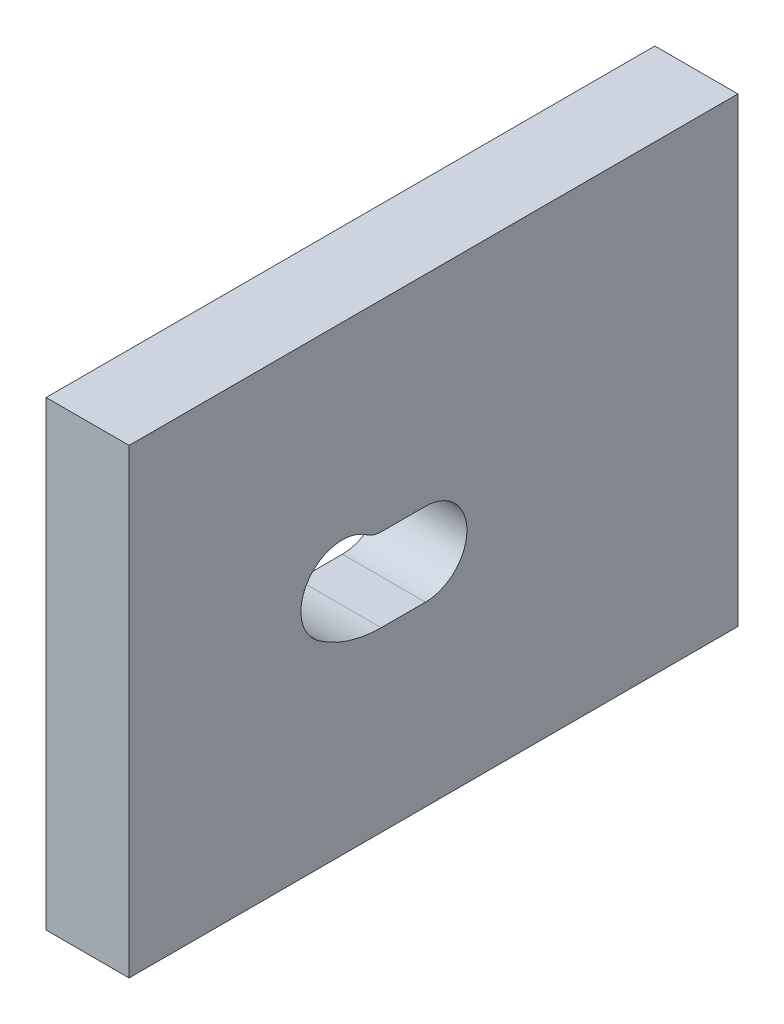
ISO-10303-21;
HEADER;
FILE_DESCRIPTION(('STEP AP214'),'2;1');
FILE_NAME('part.step','',(''),(''),'','','');
FILE_SCHEMA(('AUTOMOTIVE_DESIGN { 1 0 10303 214 1 1 1 1 }'));
ENDSEC;
DATA;
#1=APPLICATION_CONTEXT('core data for automotive mechanical design processes');
#2=APPLICATION_PROTOCOL_DEFINITION('international standard','automotive_design',2000,#1);
#3=PRODUCT_CONTEXT('',#1,'mechanical');
#4=PRODUCT('Part','Part','',(#3));
#5=PRODUCT_RELATED_PRODUCT_CATEGORY('part','',(#4));
#6=PRODUCT_DEFINITION_FORMATION('','',#4);
#7=PRODUCT_DEFINITION_CONTEXT('part definition',#1,'design');
#8=PRODUCT_DEFINITION('design','',#6,#7);
#9=PRODUCT_DEFINITION_SHAPE('','',#8);
#10=(LENGTH_UNIT() NAMED_UNIT(*) SI_UNIT(.MILLI.,.METRE.));
#11=(NAMED_UNIT(*) PLANE_ANGLE_UNIT() SI_UNIT($,.RADIAN.));
#12=(NAMED_UNIT(*) SI_UNIT($,.STERADIAN.) SOLID_ANGLE_UNIT());
#13=UNCERTAINTY_MEASURE_WITH_UNIT(LENGTH_MEASURE(1.E-05),#10,'distance_accuracy_value','');
#14=(GEOMETRIC_REPRESENTATION_CONTEXT(3) GLOBAL_UNCERTAINTY_ASSIGNED_CONTEXT((#13)) GLOBAL_UNIT_ASSIGNED_CONTEXT((#10,
#11,#12)) REPRESENTATION_CONTEXT('',''));
#15=CARTESIAN_POINT('',(0.,0.,0.));
#16=DIRECTION('',(0.,0.,1.));
#17=DIRECTION('',(1.,0.,0.));
#18=AXIS2_PLACEMENT_3D('',#15,#16,#17);
#19=CARTESIAN_POINT('',(20.,-52.7269870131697,60.7218289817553));
#20=DIRECTION('',(1.,0.,0.));
#21=DIRECTION('',(0.,0.,-1.));
#22=AXIS2_PLACEMENT_3D('',#19,#20,#21);
#23=PLANE('',#22);
#24=DIRECTION('',(0.,-1.,0.));
#25=VECTOR('',#24,1.);
#26=CARTESIAN_POINT('',(20.,58.40035883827,60.7218289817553));
#27=LINE('',#26,#25);
#28=CARTESIAN_POINT('',(20.,58.40035883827,60.7218289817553));
#29=VERTEX_POINT('',#28);
#30=CARTESIAN_POINT('',(20.,-52.7269870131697,60.7218289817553));
#31=VERTEX_POINT('',#30);
#32=EDGE_CURVE('E161',#29,#31,#27,.T.);
#33=ORIENTED_EDGE('',*,*,#32,.T.);
#34=DIRECTION('',(0.,0.,-1.));
#35=VECTOR('',#34,1.);
#36=CARTESIAN_POINT('',(20.,-52.7269870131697,60.7218289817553));
#37=LINE('',#36,#35);
#38=CARTESIAN_POINT('',(20.,-52.7269870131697,-85.9508171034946));
#39=VERTEX_POINT('',#38);
#40=EDGE_CURVE('E164',#31,#39,#37,.T.);
#41=ORIENTED_EDGE('',*,*,#40,.T.);
#42=DIRECTION('',(0.,1.,0.));
#43=VECTOR('',#42,1.);
#44=CARTESIAN_POINT('',(20.,58.40035883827,-85.9508171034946));
#45=LINE('',#44,#43);
#46=CARTESIAN_POINT('',(20.,58.40035883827,-85.9508171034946));
#47=VERTEX_POINT('',#46);
#48=EDGE_CURVE('E167',#39,#47,#45,.T.);
#49=ORIENTED_EDGE('',*,*,#48,.T.);
#50=DIRECTION('',(0.,0.,1.));
#51=VECTOR('',#50,1.);
#52=CARTESIAN_POINT('',(20.,58.40035883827,60.7218289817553));
#53=LINE('',#52,#51);
#54=EDGE_CURVE('E169',#47,#29,#53,.T.);
#55=ORIENTED_EDGE('',*,*,#54,.T.);
#56=EDGE_LOOP('',(#33,#41,#49,#55));
#57=FACE_BOUND('',#56,.T.);
#58=DIRECTION('',(0.,0.,1.));
#59=VECTOR('',#58,1.);
#60=CARTESIAN_POINT('',(20.,10.,-10.6726209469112));
#61=LINE('',#60,#59);
#62=CARTESIAN_POINT('',(20.,10.,-10.6726209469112));
#63=VERTEX_POINT('',#62);
#64=CARTESIAN_POINT('',(20.,9.99999999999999,0.));
#65=VERTEX_POINT('',#64);
#66=EDGE_CURVE('E118',#63,#65,#61,.T.);
#67=ORIENTED_EDGE('',*,*,#66,.F.);
#68=CARTESIAN_POINT('',(20.,0.,-10.6726209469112));
#69=DIRECTION('',(1.,0.,0.));
#70=DIRECTION('',(0.,0.,1.));
#71=AXIS2_PLACEMENT_3D('',#68,#69,#70);
#72=CIRCLE('',#71,10.);
#73=CARTESIAN_POINT('',(20.,-10.,-10.6726209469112));
#74=VERTEX_POINT('',#73);
#75=EDGE_CURVE('E110',#74,#63,#72,.T.);
#76=ORIENTED_EDGE('',*,*,#75,.F.);
#77=DIRECTION('',(0.,0.,-1.));
#78=VECTOR('',#77,1.);
#79=CARTESIAN_POINT('',(20.,-10.,-10.6726209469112));
#80=LINE('',#79,#78);
#81=CARTESIAN_POINT('',(20.,-10.,0.));
#82=VERTEX_POINT('',#81);
#83=EDGE_CURVE('E139',#82,#74,#80,.T.);
#84=ORIENTED_EDGE('',*,*,#83,.F.);
#85=CARTESIAN_POINT('',(20.,16.,0.));
#86=DIRECTION('',(1.,0.,0.));
#87=DIRECTION('',(0.,0.,1.));
#88=AXIS2_PLACEMENT_3D('',#85,#86,#87);
#89=CIRCLE('',#88,26.);
#90=CARTESIAN_POINT('',(20.,-5.12500000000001,15.1569909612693));
#91=VERTEX_POINT('',#90);
#92=EDGE_CURVE('E137',#91,#82,#89,.T.);
#93=ORIENTED_EDGE('',*,*,#92,.F.);
#94=CARTESIAN_POINT('',(20.,3.,9.32737905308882));
#95=DIRECTION('',(1.,0.,0.));
#96=DIRECTION('',(0.,0.,-1.));
#97=AXIS2_PLACEMENT_3D('',#94,#95,#96);
#98=CIRCLE('',#97,10.);
#99=CARTESIAN_POINT('',(20.,11.125,3.4977671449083));
#100=VERTEX_POINT('',#99);
#101=EDGE_CURVE('E133',#100,#91,#98,.T.);
#102=ORIENTED_EDGE('',*,*,#101,.F.);
#103=CARTESIAN_POINT('',(20.,16.,0.));
#104=DIRECTION('',(-1.,0.,0.));
#105=DIRECTION('',(0.,0.,1.));
#106=AXIS2_PLACEMENT_3D('',#103,#104,#105);
#107=CIRCLE('',#106,6.);
#108=EDGE_CURVE('E131',#65,#100,#107,.T.);
#109=ORIENTED_EDGE('',*,*,#108,.F.);
#110=EDGE_LOOP('',(#67,#76,#84,#93,#102,#109));
#111=FACE_BOUND('',#110,.T.);
#112=ADVANCED_FACE('F33',(#57,#111),#23,.T.);
#113=CARTESIAN_POINT('',(0.,-52.7269870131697,60.7218289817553));
#114=DIRECTION('',(1.,0.,0.));
#115=DIRECTION('',(0.,0.,-1.));
#116=AXIS2_PLACEMENT_3D('',#113,#114,#115);
#117=PLANE('',#116);
#118=DIRECTION('',(0.,-1.,0.));
#119=VECTOR('',#118,1.);
#120=CARTESIAN_POINT('',(0.,58.40035883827,60.7218289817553));
#121=LINE('',#120,#119);
#122=CARTESIAN_POINT('',(0.,58.40035883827,60.7218289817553));
#123=VERTEX_POINT('',#122);
#124=CARTESIAN_POINT('',(0.,-52.7269870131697,60.7218289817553));
#125=VERTEX_POINT('',#124);
#126=EDGE_CURVE('E126',#123,#125,#121,.T.);
#127=ORIENTED_EDGE('',*,*,#126,.F.);
#128=DIRECTION('',(0.,0.,1.));
#129=VECTOR('',#128,1.);
#130=CARTESIAN_POINT('',(0.,58.40035883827,60.7218289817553));
#131=LINE('',#130,#129);
#132=CARTESIAN_POINT('',(0.,58.40035883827,-85.9508171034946));
#133=VERTEX_POINT('',#132);
#134=EDGE_CURVE('E165',#133,#123,#131,.T.);
#135=ORIENTED_EDGE('',*,*,#134,.F.);
#136=DIRECTION('',(0.,1.,0.));
#137=VECTOR('',#136,1.);
#138=CARTESIAN_POINT('',(0.,58.40035883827,-85.9508171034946));
#139=LINE('',#138,#137);
#140=CARTESIAN_POINT('',(0.,-52.7269870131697,-85.9508171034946));
#141=VERTEX_POINT('',#140);
#142=EDGE_CURVE('E176',#141,#133,#139,.T.);
#143=ORIENTED_EDGE('',*,*,#142,.F.);
#144=DIRECTION('',(0.,0.,-1.));
#145=VECTOR('',#144,1.);
#146=CARTESIAN_POINT('',(0.,-52.7269870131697,60.7218289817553));
#147=LINE('',#146,#145);
#148=EDGE_CURVE('E174',#125,#141,#147,.T.);
#149=ORIENTED_EDGE('',*,*,#148,.F.);
#150=EDGE_LOOP('',(#127,#135,#143,#149));
#151=FACE_BOUND('',#150,.T.);
#152=CARTESIAN_POINT('',(0.,0.,-10.6726209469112));
#153=DIRECTION('',(1.,0.,0.));
#154=DIRECTION('',(0.,0.,1.));
#155=AXIS2_PLACEMENT_3D('',#152,#153,#154);
#156=CIRCLE('',#155,10.);
#157=CARTESIAN_POINT('',(0.,-10.,-10.6726209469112));
#158=VERTEX_POINT('',#157);
#159=CARTESIAN_POINT('',(0.,10.,-10.6726209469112));
#160=VERTEX_POINT('',#159);
#161=EDGE_CURVE('E56',#158,#160,#156,.T.);
#162=ORIENTED_EDGE('',*,*,#161,.T.);
#163=DIRECTION('',(0.,0.,1.));
#164=VECTOR('',#163,1.);
#165=CARTESIAN_POINT('',(0.,10.,-10.6726209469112));
#166=LINE('',#165,#164);
#167=CARTESIAN_POINT('',(0.,9.99999999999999,0.));
#168=VERTEX_POINT('',#167);
#169=EDGE_CURVE('E125',#160,#168,#166,.T.);
#170=ORIENTED_EDGE('',*,*,#169,.T.);
#171=CARTESIAN_POINT('',(0.,16.,0.));
#172=DIRECTION('',(-1.,0.,0.));
#173=DIRECTION('',(0.,0.,1.));
#174=AXIS2_PLACEMENT_3D('',#171,#172,#173);
#175=CIRCLE('',#174,6.);
#176=CARTESIAN_POINT('',(0.,11.125,3.4977671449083));
#177=VERTEX_POINT('',#176);
#178=EDGE_CURVE('E143',#168,#177,#175,.T.);
#179=ORIENTED_EDGE('',*,*,#178,.T.);
#180=CARTESIAN_POINT('',(0.,3.,9.32737905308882));
#181=DIRECTION('',(1.,0.,0.));
#182=DIRECTION('',(0.,0.,-1.));
#183=AXIS2_PLACEMENT_3D('',#180,#181,#182);
#184=CIRCLE('',#183,10.);
#185=CARTESIAN_POINT('',(0.,-5.12500000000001,15.1569909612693));
#186=VERTEX_POINT('',#185);
#187=EDGE_CURVE('E146',#177,#186,#184,.T.);
#188=ORIENTED_EDGE('',*,*,#187,.T.);
#189=CARTESIAN_POINT('',(0.,16.,0.));
#190=DIRECTION('',(1.,0.,0.));
#191=DIRECTION('',(0.,0.,1.));
#192=AXIS2_PLACEMENT_3D('',#189,#190,#191);
#193=CIRCLE('',#192,26.);
#194=CARTESIAN_POINT('',(0.,-10.,0.));
#195=VERTEX_POINT('',#194);
#196=EDGE_CURVE('E149',#186,#195,#193,.T.);
#197=ORIENTED_EDGE('',*,*,#196,.T.);
#198=DIRECTION('',(0.,0.,-1.));
#199=VECTOR('',#198,1.);
#200=CARTESIAN_POINT('',(0.,-10.,-10.6726209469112));
#201=LINE('',#200,#199);
#202=EDGE_CURVE('E119',#195,#158,#201,.T.);
#203=ORIENTED_EDGE('',*,*,#202,.T.);
#204=EDGE_LOOP('',(#162,#170,#179,#188,#197,#203));
#205=FACE_BOUND('',#204,.T.);
#206=ADVANCED_FACE('F194',(#151,#205),#117,.F.);
#207=CARTESIAN_POINT('',(20.,58.40035883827,60.7218289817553));
#208=DIRECTION('',(0.,0.,-1.));
#209=DIRECTION('',(0.,1.,0.));
#210=AXIS2_PLACEMENT_3D('',#207,#208,#209);
#211=PLANE('',#210);
#212=ORIENTED_EDGE('',*,*,#126,.T.);
#213=DIRECTION('',(-1.,0.,0.));
#214=VECTOR('',#213,1.);
#215=CARTESIAN_POINT('',(20.,-52.7269870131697,60.7218289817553));
#216=LINE('',#215,#214);
#217=EDGE_CURVE('E11',#31,#125,#216,.T.);
#218=ORIENTED_EDGE('',*,*,#217,.F.);
#219=ORIENTED_EDGE('',*,*,#32,.F.);
#220=DIRECTION('',(-1.,0.,0.));
#221=VECTOR('',#220,1.);
#222=CARTESIAN_POINT('',(20.,58.40035883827,60.7218289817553));
#223=LINE('',#222,#221);
#224=EDGE_CURVE('E171',#29,#123,#223,.T.);
#225=ORIENTED_EDGE('',*,*,#224,.T.);
#226=EDGE_LOOP('',(#212,#218,#219,#225));
#227=FACE_BOUND('',#226,.T.);
#228=ADVANCED_FACE('F35',(#227),#211,.F.);
#229=CARTESIAN_POINT('',(20.,-52.7269870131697,60.7218289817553));
#230=DIRECTION('',(0.,1.,0.));
#231=DIRECTION('',(0.,0.,1.));
#232=AXIS2_PLACEMENT_3D('',#229,#230,#231);
#233=PLANE('',#232);
#234=ORIENTED_EDGE('',*,*,#148,.T.);
#235=DIRECTION('',(-1.,0.,0.));
#236=VECTOR('',#235,1.);
#237=CARTESIAN_POINT('',(20.,-52.7269870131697,-85.9508171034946));
#238=LINE('',#237,#236);
#239=EDGE_CURVE('E41',#39,#141,#238,.T.);
#240=ORIENTED_EDGE('',*,*,#239,.F.);
#241=ORIENTED_EDGE('',*,*,#40,.F.);
#242=ORIENTED_EDGE('',*,*,#217,.T.);
#243=EDGE_LOOP('',(#234,#240,#241,#242));
#244=FACE_BOUND('',#243,.T.);
#245=ADVANCED_FACE('F204',(#244),#233,.F.);
#246=CARTESIAN_POINT('',(20.,58.40035883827,-85.9508171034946));
#247=DIRECTION('',(0.,0.,1.));
#248=DIRECTION('',(1.,0.,0.));
#249=AXIS2_PLACEMENT_3D('',#246,#247,#248);
#250=PLANE('',#249);
#251=ORIENTED_EDGE('',*,*,#142,.T.);
#252=DIRECTION('',(-1.,0.,0.));
#253=VECTOR('',#252,1.);
#254=CARTESIAN_POINT('',(20.,58.40035883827,-85.9508171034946));
#255=LINE('',#254,#253);
#256=EDGE_CURVE('E181',#47,#133,#255,.T.);
#257=ORIENTED_EDGE('',*,*,#256,.F.);
#258=ORIENTED_EDGE('',*,*,#48,.F.);
#259=ORIENTED_EDGE('',*,*,#239,.T.);
#260=EDGE_LOOP('',(#251,#257,#258,#259));
#261=FACE_BOUND('',#260,.T.);
#262=ADVANCED_FACE('F188',(#261),#250,.F.);
#263=CARTESIAN_POINT('',(20.,58.40035883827,60.7218289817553));
#264=DIRECTION('',(0.,-1.,0.));
#265=DIRECTION('',(0.,0.,-1.));
#266=AXIS2_PLACEMENT_3D('',#263,#264,#265);
#267=PLANE('',#266);
#268=ORIENTED_EDGE('',*,*,#134,.T.);
#269=ORIENTED_EDGE('',*,*,#224,.F.);
#270=ORIENTED_EDGE('',*,*,#54,.F.);
#271=ORIENTED_EDGE('',*,*,#256,.T.);
#272=EDGE_LOOP('',(#268,#269,#270,#271));
#273=FACE_BOUND('',#272,.T.);
#274=ADVANCED_FACE('F198',(#273),#267,.F.);
#275=CARTESIAN_POINT('',(20.,0.,-10.6726209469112));
#276=DIRECTION('',(-1.,0.,0.));
#277=DIRECTION('',(0.,0.,1.));
#278=AXIS2_PLACEMENT_3D('',#275,#276,#277);
#279=CYLINDRICAL_SURFACE('',#278,10.);
#280=ORIENTED_EDGE('',*,*,#161,.F.);
#281=DIRECTION('',(-1.,0.,0.));
#282=VECTOR('',#281,1.);
#283=CARTESIAN_POINT('',(20.,-10.,-10.6726209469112));
#284=LINE('',#283,#282);
#285=EDGE_CURVE('E114',#74,#158,#284,.T.);
#286=ORIENTED_EDGE('',*,*,#285,.F.);
#287=ORIENTED_EDGE('',*,*,#75,.T.);
#288=DIRECTION('',(-1.,0.,0.));
#289=VECTOR('',#288,1.);
#290=CARTESIAN_POINT('',(20.,10.,-10.6726209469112));
#291=LINE('',#290,#289);
#292=EDGE_CURVE('E113',#63,#160,#291,.T.);
#293=ORIENTED_EDGE('',*,*,#292,.T.);
#294=EDGE_LOOP('',(#280,#286,#287,#293));
#295=FACE_BOUND('',#294,.T.);
#296=ADVANCED_FACE('F112',(#295),#279,.F.);
#297=CARTESIAN_POINT('',(20.,10.,-10.6726209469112));
#298=DIRECTION('',(0.,-1.,0.));
#299=DIRECTION('',(0.,0.,-1.));
#300=AXIS2_PLACEMENT_3D('',#297,#298,#299);
#301=PLANE('',#300);
#302=ORIENTED_EDGE('',*,*,#169,.F.);
#303=ORIENTED_EDGE('',*,*,#292,.F.);
#304=ORIENTED_EDGE('',*,*,#66,.T.);
#305=DIRECTION('',(-1.,0.,0.));
#306=VECTOR('',#305,1.);
#307=CARTESIAN_POINT('',(20.,9.99999999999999,0.));
#308=LINE('',#307,#306);
#309=EDGE_CURVE('E127',#65,#168,#308,.T.);
#310=ORIENTED_EDGE('',*,*,#309,.T.);
#311=EDGE_LOOP('',(#302,#303,#304,#310));
#312=FACE_BOUND('',#311,.T.);
#313=ADVANCED_FACE('F122',(#312),#301,.T.);
#314=CARTESIAN_POINT('',(20.,16.,0.));
#315=DIRECTION('',(-1.,0.,0.));
#316=DIRECTION('',(0.,0.,1.));
#317=AXIS2_PLACEMENT_3D('',#314,#315,#316);
#318=CYLINDRICAL_SURFACE('',#317,6.);
#319=ORIENTED_EDGE('',*,*,#178,.F.);
#320=ORIENTED_EDGE('',*,*,#309,.F.);
#321=ORIENTED_EDGE('',*,*,#108,.T.);
#322=DIRECTION('',(-1.,0.,0.));
#323=VECTOR('',#322,1.);
#324=CARTESIAN_POINT('',(20.,11.125,3.4977671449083));
#325=LINE('',#324,#323);
#326=EDGE_CURVE('E158',#100,#177,#325,.T.);
#327=ORIENTED_EDGE('',*,*,#326,.T.);
#328=EDGE_LOOP('',(#319,#320,#321,#327));
#329=FACE_BOUND('',#328,.T.);
#330=ADVANCED_FACE('F227',(#329),#318,.T.);
#331=CARTESIAN_POINT('',(20.,3.,9.32737905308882));
#332=DIRECTION('',(-1.,0.,0.));
#333=DIRECTION('',(0.,0.,1.));
#334=AXIS2_PLACEMENT_3D('',#331,#332,#333);
#335=CYLINDRICAL_SURFACE('',#334,10.);
#336=ORIENTED_EDGE('',*,*,#187,.F.);
#337=ORIENTED_EDGE('',*,*,#326,.F.);
#338=ORIENTED_EDGE('',*,*,#101,.T.);
#339=DIRECTION('',(-1.,0.,0.));
#340=VECTOR('',#339,1.);
#341=CARTESIAN_POINT('',(20.,-5.12500000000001,15.1569909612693));
#342=LINE('',#341,#340);
#343=EDGE_CURVE('E156',#91,#186,#342,.T.);
#344=ORIENTED_EDGE('',*,*,#343,.T.);
#345=EDGE_LOOP('',(#336,#337,#338,#344));
#346=FACE_BOUND('',#345,.T.);
#347=ADVANCED_FACE('F231',(#346),#335,.F.);
#348=CARTESIAN_POINT('',(20.,16.,0.));
#349=DIRECTION('',(-1.,0.,0.));
#350=DIRECTION('',(0.,0.,1.));
#351=AXIS2_PLACEMENT_3D('',#348,#349,#350);
#352=CYLINDRICAL_SURFACE('',#351,26.);
#353=ORIENTED_EDGE('',*,*,#196,.F.);
#354=ORIENTED_EDGE('',*,*,#343,.F.);
#355=ORIENTED_EDGE('',*,*,#92,.T.);
#356=DIRECTION('',(-1.,0.,0.));
#357=VECTOR('',#356,1.);
#358=CARTESIAN_POINT('',(20.,-10.,0.));
#359=LINE('',#358,#357);
#360=EDGE_CURVE('E48',#82,#195,#359,.T.);
#361=ORIENTED_EDGE('',*,*,#360,.T.);
#362=EDGE_LOOP('',(#353,#354,#355,#361));
#363=FACE_BOUND('',#362,.T.);
#364=ADVANCED_FACE('F237',(#363),#352,.F.);
#365=CARTESIAN_POINT('',(20.,-10.,-10.6726209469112));
#366=DIRECTION('',(0.,1.,0.));
#367=DIRECTION('',(0.,0.,1.));
#368=AXIS2_PLACEMENT_3D('',#365,#366,#367);
#369=PLANE('',#368);
#370=ORIENTED_EDGE('',*,*,#202,.F.);
#371=ORIENTED_EDGE('',*,*,#360,.F.);
#372=ORIENTED_EDGE('',*,*,#83,.T.);
#373=ORIENTED_EDGE('',*,*,#285,.T.);
#374=EDGE_LOOP('',(#370,#371,#372,#373));
#375=FACE_BOUND('',#374,.T.);
#376=ADVANCED_FACE('F241',(#375),#369,.T.);
#377=CLOSED_SHELL('',(#112,#206,#228,#245,#262,#274,#296,#313,#330,#347,#364,#376));
#378=MANIFOLD_SOLID_BREP('B2',#377);
#379=ADVANCED_BREP_SHAPE_REPRESENTATION('',(#18,#378),#14);
#380=SHAPE_DEFINITION_REPRESENTATION(#9,#379);
ENDSEC;
END-ISO-10303-21;
